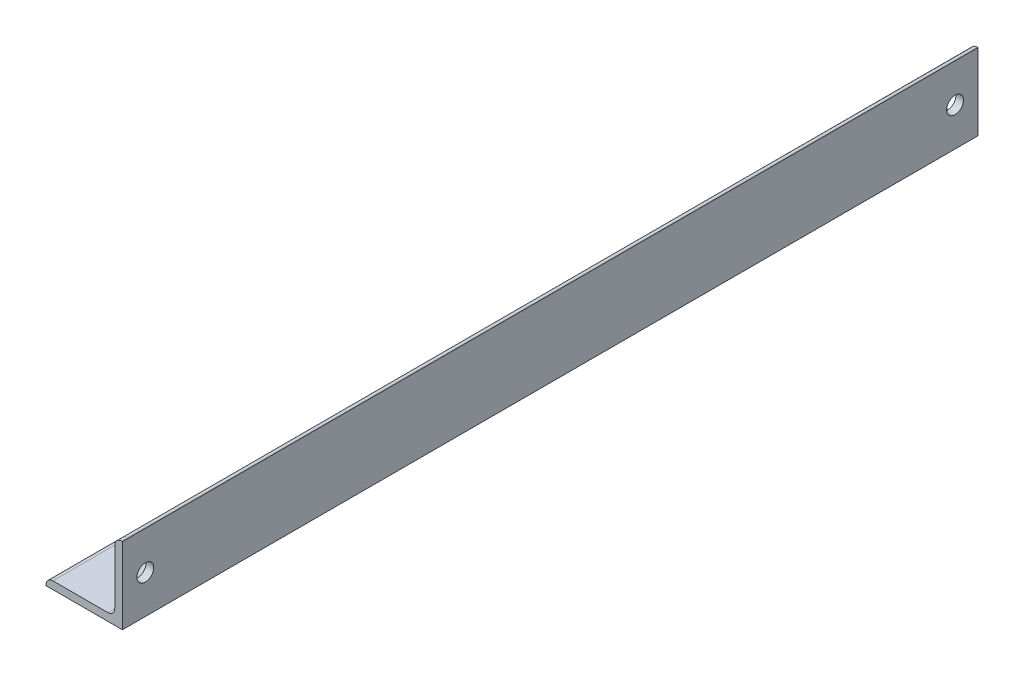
ISO-10303-21;
HEADER;
FILE_DESCRIPTION(('STEP AP214'),'2;1');
FILE_NAME('part.step','',(''),(''),'','','');
FILE_SCHEMA(('AUTOMOTIVE_DESIGN { 1 0 10303 214 1 1 1 1 }'));
ENDSEC;
DATA;
#1=APPLICATION_CONTEXT('core data for automotive mechanical design processes');
#2=APPLICATION_PROTOCOL_DEFINITION('international standard','automotive_design',2000,#1);
#3=PRODUCT_CONTEXT('',#1,'mechanical');
#4=PRODUCT('Part','Part','',(#3));
#5=PRODUCT_RELATED_PRODUCT_CATEGORY('part','',(#4));
#6=PRODUCT_DEFINITION_FORMATION('','',#4);
#7=PRODUCT_DEFINITION_CONTEXT('part definition',#1,'design');
#8=PRODUCT_DEFINITION('design','',#6,#7);
#9=PRODUCT_DEFINITION_SHAPE('','',#8);
#10=(LENGTH_UNIT() NAMED_UNIT(*) SI_UNIT(.MILLI.,.METRE.));
#11=(NAMED_UNIT(*) PLANE_ANGLE_UNIT() SI_UNIT($,.RADIAN.));
#12=(NAMED_UNIT(*) SI_UNIT($,.STERADIAN.) SOLID_ANGLE_UNIT());
#13=UNCERTAINTY_MEASURE_WITH_UNIT(LENGTH_MEASURE(1.E-05),#10,'distance_accuracy_value','');
#14=(GEOMETRIC_REPRESENTATION_CONTEXT(3) GLOBAL_UNCERTAINTY_ASSIGNED_CONTEXT((#13)) GLOBAL_UNIT_ASSIGNED_CONTEXT((#10,
#11,#12)) REPRESENTATION_CONTEXT('',''));
#15=CARTESIAN_POINT('',(0.,0.,0.));
#16=DIRECTION('',(0.,0.,1.));
#17=DIRECTION('',(1.,0.,0.));
#18=AXIS2_PLACEMENT_3D('',#15,#16,#17);
#19=CARTESIAN_POINT('',(0.,0.,560.));
#20=DIRECTION('',(0.,1.,0.));
#21=DIRECTION('',(-1.,0.,0.));
#22=AXIS2_PLACEMENT_3D('',#19,#20,#21);
#23=PLANE('',#22);
#24=DIRECTION('',(1.,0.,0.));
#25=VECTOR('',#24,1.);
#26=CARTESIAN_POINT('',(0.,0.,0.));
#27=LINE('',#26,#25);
#28=CARTESIAN_POINT('',(-50.,0.,0.));
#29=VERTEX_POINT('',#28);
#30=CARTESIAN_POINT('',(0.,0.,0.));
#31=VERTEX_POINT('',#30);
#32=EDGE_CURVE('E105',#29,#31,#27,.T.);
#33=ORIENTED_EDGE('',*,*,#32,.T.);
#34=DIRECTION('',(0.,0.,-1.));
#35=VECTOR('',#34,1.);
#36=CARTESIAN_POINT('',(0.,0.,560.));
#37=LINE('',#36,#35);
#38=CARTESIAN_POINT('',(0.,0.,560.));
#39=VERTEX_POINT('',#38);
#40=EDGE_CURVE('E11',#39,#31,#37,.T.);
#41=ORIENTED_EDGE('',*,*,#40,.F.);
#42=DIRECTION('',(1.,0.,0.));
#43=VECTOR('',#42,1.);
#44=CARTESIAN_POINT('',(0.,0.,560.));
#45=LINE('',#44,#43);
#46=CARTESIAN_POINT('',(-50.,0.,560.));
#47=VERTEX_POINT('',#46);
#48=EDGE_CURVE('E139',#47,#39,#45,.T.);
#49=ORIENTED_EDGE('',*,*,#48,.F.);
#50=DIRECTION('',(0.,0.,-1.));
#51=VECTOR('',#50,1.);
#52=CARTESIAN_POINT('',(-50.,0.,560.));
#53=LINE('',#52,#51);
#54=EDGE_CURVE('E118',#47,#29,#53,.T.);
#55=ORIENTED_EDGE('',*,*,#54,.T.);
#56=EDGE_LOOP('',(#33,#41,#49,#55));
#57=FACE_BOUND('',#56,.T.);
#58=ADVANCED_FACE('F29',(#57),#23,.F.);
#59=CARTESIAN_POINT('',(0.,0.,560.));
#60=DIRECTION('',(-1.,0.,0.));
#61=DIRECTION('',(0.,0.,1.));
#62=AXIS2_PLACEMENT_3D('',#59,#60,#61);
#63=PLANE('',#62);
#64=CARTESIAN_POINT('',(0.,25.,15.));
#65=DIRECTION('',(1.,0.,0.));
#66=DIRECTION('',(0.,0.,-1.));
#67=AXIS2_PLACEMENT_3D('',#64,#65,#66);
#68=CIRCLE('',#67,5.5);
#69=CARTESIAN_POINT('',(0.,25.,9.50000000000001));
#70=VERTEX_POINT('',#69);
#71=EDGE_CURVE('E283',#70,#70,#68,.T.);
#72=ORIENTED_EDGE('',*,*,#71,.F.);
#73=EDGE_LOOP('',(#72));
#74=FACE_BOUND('',#73,.T.);
#75=CARTESIAN_POINT('',(0.,25.,545.));
#76=DIRECTION('',(1.,0.,0.));
#77=DIRECTION('',(0.,0.,-1.));
#78=AXIS2_PLACEMENT_3D('',#75,#76,#77);
#79=CIRCLE('',#78,5.49999999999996);
#80=CARTESIAN_POINT('',(0.,25.,539.5));
#81=VERTEX_POINT('',#80);
#82=EDGE_CURVE('E122',#81,#81,#79,.T.);
#83=ORIENTED_EDGE('',*,*,#82,.F.);
#84=EDGE_LOOP('',(#83));
#85=FACE_BOUND('',#84,.T.);
#86=DIRECTION('',(0.,1.,0.));
#87=VECTOR('',#86,1.);
#88=CARTESIAN_POINT('',(0.,0.,0.));
#89=LINE('',#88,#87);
#90=CARTESIAN_POINT('',(0.,50.,0.));
#91=VERTEX_POINT('',#90);
#92=EDGE_CURVE('E101',#31,#91,#89,.T.);
#93=ORIENTED_EDGE('',*,*,#92,.T.);
#94=DIRECTION('',(0.,0.,-1.));
#95=VECTOR('',#94,1.);
#96=CARTESIAN_POINT('',(0.,50.,560.));
#97=LINE('',#96,#95);
#98=CARTESIAN_POINT('',(0.,50.,560.));
#99=VERTEX_POINT('',#98);
#100=EDGE_CURVE('E37',#99,#91,#97,.T.);
#101=ORIENTED_EDGE('',*,*,#100,.F.);
#102=DIRECTION('',(0.,1.,0.));
#103=VECTOR('',#102,1.);
#104=CARTESIAN_POINT('',(0.,0.,560.));
#105=LINE('',#104,#103);
#106=EDGE_CURVE('E114',#39,#99,#105,.T.);
#107=ORIENTED_EDGE('',*,*,#106,.F.);
#108=ORIENTED_EDGE('',*,*,#40,.T.);
#109=EDGE_LOOP('',(#93,#101,#107,#108));
#110=FACE_BOUND('',#109,.T.);
#111=ADVANCED_FACE('F113',(#74,#85,#110),#63,.F.);
#112=CARTESIAN_POINT('',(0.,50.,560.));
#113=DIRECTION('',(0.,-1.,0.));
#114=DIRECTION('',(0.,0.,-1.));
#115=AXIS2_PLACEMENT_3D('',#112,#113,#114);
#116=PLANE('',#115);
#117=DIRECTION('',(-1.,0.,0.));
#118=VECTOR('',#117,1.);
#119=CARTESIAN_POINT('',(0.,50.,0.));
#120=LINE('',#119,#118);
#121=CARTESIAN_POINT('',(-0.499999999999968,50.,0.));
#122=VERTEX_POINT('',#121);
#123=EDGE_CURVE('E107',#91,#122,#120,.T.);
#124=ORIENTED_EDGE('',*,*,#123,.T.);
#125=DIRECTION('',(0.,0.,-1.));
#126=VECTOR('',#125,1.);
#127=CARTESIAN_POINT('',(-0.499999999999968,50.,560.));
#128=LINE('',#127,#126);
#129=CARTESIAN_POINT('',(-0.499999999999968,50.,560.));
#130=VERTEX_POINT('',#129);
#131=EDGE_CURVE('E170',#130,#122,#128,.T.);
#132=ORIENTED_EDGE('',*,*,#131,.F.);
#133=DIRECTION('',(-1.,0.,0.));
#134=VECTOR('',#133,1.);
#135=CARTESIAN_POINT('',(0.,50.,560.));
#136=LINE('',#135,#134);
#137=EDGE_CURVE('E142',#99,#130,#136,.T.);
#138=ORIENTED_EDGE('',*,*,#137,.F.);
#139=ORIENTED_EDGE('',*,*,#100,.T.);
#140=EDGE_LOOP('',(#124,#132,#138,#139));
#141=FACE_BOUND('',#140,.T.);
#142=ADVANCED_FACE('F175',(#141),#116,.F.);
#143=CARTESIAN_POINT('',(-0.5,45.5,560.));
#144=DIRECTION('',(0.,0.,-1.));
#145=DIRECTION('',(-1.,0.,0.));
#146=AXIS2_PLACEMENT_3D('',#143,#144,#145);
#147=CYLINDRICAL_SURFACE('',#146,4.5);
#148=CARTESIAN_POINT('',(-0.5,45.5,0.));
#149=DIRECTION('',(0.,0.,1.));
#150=DIRECTION('',(1.,0.,0.));
#151=AXIS2_PLACEMENT_3D('',#148,#149,#150);
#152=CIRCLE('',#151,4.5);
#153=CARTESIAN_POINT('',(-5.,45.5,0.));
#154=VERTEX_POINT('',#153);
#155=EDGE_CURVE('E127',#122,#154,#152,.T.);
#156=ORIENTED_EDGE('',*,*,#155,.T.);
#157=DIRECTION('',(0.,0.,-1.));
#158=VECTOR('',#157,1.);
#159=CARTESIAN_POINT('',(-5.,45.5,560.));
#160=LINE('',#159,#158);
#161=CARTESIAN_POINT('',(-5.,45.5,560.));
#162=VERTEX_POINT('',#161);
#163=EDGE_CURVE('E167',#162,#154,#160,.T.);
#164=ORIENTED_EDGE('',*,*,#163,.F.);
#165=CARTESIAN_POINT('',(-0.5,45.5,560.));
#166=DIRECTION('',(0.,0.,1.));
#167=DIRECTION('',(1.,0.,0.));
#168=AXIS2_PLACEMENT_3D('',#165,#166,#167);
#169=CIRCLE('',#168,4.5);
#170=EDGE_CURVE('E144',#130,#162,#169,.T.);
#171=ORIENTED_EDGE('',*,*,#170,.F.);
#172=ORIENTED_EDGE('',*,*,#131,.T.);
#173=EDGE_LOOP('',(#156,#164,#171,#172));
#174=FACE_BOUND('',#173,.T.);
#175=ADVANCED_FACE('F183',(#174),#147,.T.);
#176=CARTESIAN_POINT('',(-5.,9.50000000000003,560.));
#177=DIRECTION('',(1.,0.,0.));
#178=DIRECTION('',(0.,0.,-1.));
#179=AXIS2_PLACEMENT_3D('',#176,#177,#178);
#180=PLANE('',#179);
#181=CARTESIAN_POINT('',(-5.,25.,15.));
#182=DIRECTION('',(1.,0.,0.));
#183=DIRECTION('',(0.,0.,-1.));
#184=AXIS2_PLACEMENT_3D('',#181,#182,#183);
#185=CIRCLE('',#184,5.5);
#186=CARTESIAN_POINT('',(-5.,25.,9.50000000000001));
#187=VERTEX_POINT('',#186);
#188=EDGE_CURVE('E32',#187,#187,#185,.T.);
#189=ORIENTED_EDGE('',*,*,#188,.T.);
#190=EDGE_LOOP('',(#189));
#191=FACE_BOUND('',#190,.T.);
#192=CARTESIAN_POINT('',(-5.,25.,545.));
#193=DIRECTION('',(1.,0.,0.));
#194=DIRECTION('',(0.,0.,-1.));
#195=AXIS2_PLACEMENT_3D('',#192,#193,#194);
#196=CIRCLE('',#195,5.49999999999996);
#197=CARTESIAN_POINT('',(-5.,25.,539.5));
#198=VERTEX_POINT('',#197);
#199=EDGE_CURVE('E119',#198,#198,#196,.T.);
#200=ORIENTED_EDGE('',*,*,#199,.T.);
#201=EDGE_LOOP('',(#200));
#202=FACE_BOUND('',#201,.T.);
#203=DIRECTION('',(0.,-1.,0.));
#204=VECTOR('',#203,1.);
#205=CARTESIAN_POINT('',(-5.,9.50000000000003,0.));
#206=LINE('',#205,#204);
#207=CARTESIAN_POINT('',(-5.,9.50000000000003,0.));
#208=VERTEX_POINT('',#207);
#209=EDGE_CURVE('E129',#154,#208,#206,.T.);
#210=ORIENTED_EDGE('',*,*,#209,.T.);
#211=DIRECTION('',(0.,0.,-1.));
#212=VECTOR('',#211,1.);
#213=CARTESIAN_POINT('',(-5.,9.50000000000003,560.));
#214=LINE('',#213,#212);
#215=CARTESIAN_POINT('',(-5.,9.50000000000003,560.));
#216=VERTEX_POINT('',#215);
#217=EDGE_CURVE('E164',#216,#208,#214,.T.);
#218=ORIENTED_EDGE('',*,*,#217,.F.);
#219=DIRECTION('',(0.,-1.,0.));
#220=VECTOR('',#219,1.);
#221=CARTESIAN_POINT('',(-5.,9.50000000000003,560.));
#222=LINE('',#221,#220);
#223=EDGE_CURVE('E146',#162,#216,#222,.T.);
#224=ORIENTED_EDGE('',*,*,#223,.F.);
#225=ORIENTED_EDGE('',*,*,#163,.T.);
#226=EDGE_LOOP('',(#210,#218,#224,#225));
#227=FACE_BOUND('',#226,.T.);
#228=ADVANCED_FACE('F186',(#191,#202,#227),#180,.F.);
#229=CARTESIAN_POINT('',(-9.5,9.5,560.));
#230=DIRECTION('',(0.,0.,-1.));
#231=DIRECTION('',(-1.,0.,0.));
#232=AXIS2_PLACEMENT_3D('',#229,#230,#231);
#233=CYLINDRICAL_SURFACE('',#232,4.5);
#234=CARTESIAN_POINT('',(-9.5,9.5,0.));
#235=DIRECTION('',(0.,0.,-1.));
#236=DIRECTION('',(1.,0.,0.));
#237=AXIS2_PLACEMENT_3D('',#234,#235,#236);
#238=CIRCLE('',#237,4.5);
#239=CARTESIAN_POINT('',(-9.50000000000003,5.,0.));
#240=VERTEX_POINT('',#239);
#241=EDGE_CURVE('E131',#208,#240,#238,.T.);
#242=ORIENTED_EDGE('',*,*,#241,.T.);
#243=DIRECTION('',(0.,0.,-1.));
#244=VECTOR('',#243,1.);
#245=CARTESIAN_POINT('',(-9.50000000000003,5.,560.));
#246=LINE('',#245,#244);
#247=CARTESIAN_POINT('',(-9.50000000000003,5.,560.));
#248=VERTEX_POINT('',#247);
#249=EDGE_CURVE('E161',#248,#240,#246,.T.);
#250=ORIENTED_EDGE('',*,*,#249,.F.);
#251=CARTESIAN_POINT('',(-9.5,9.5,560.));
#252=DIRECTION('',(0.,0.,-1.));
#253=DIRECTION('',(1.,0.,0.));
#254=AXIS2_PLACEMENT_3D('',#251,#252,#253);
#255=CIRCLE('',#254,4.5);
#256=EDGE_CURVE('E148',#216,#248,#255,.T.);
#257=ORIENTED_EDGE('',*,*,#256,.F.);
#258=ORIENTED_EDGE('',*,*,#217,.T.);
#259=EDGE_LOOP('',(#242,#250,#257,#258));
#260=FACE_BOUND('',#259,.T.);
#261=ADVANCED_FACE('F191',(#260),#233,.F.);
#262=CARTESIAN_POINT('',(-9.50000000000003,5.,560.));
#263=DIRECTION('',(0.,-1.,0.));
#264=DIRECTION('',(1.,0.,0.));
#265=AXIS2_PLACEMENT_3D('',#262,#263,#264);
#266=PLANE('',#265);
#267=DIRECTION('',(-1.,0.,0.));
#268=VECTOR('',#267,1.);
#269=CARTESIAN_POINT('',(-9.50000000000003,5.,0.));
#270=LINE('',#269,#268);
#271=CARTESIAN_POINT('',(-45.5,4.99999999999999,0.));
#272=VERTEX_POINT('',#271);
#273=EDGE_CURVE('E133',#240,#272,#270,.T.);
#274=ORIENTED_EDGE('',*,*,#273,.T.);
#275=DIRECTION('',(0.,0.,-1.));
#276=VECTOR('',#275,1.);
#277=CARTESIAN_POINT('',(-45.5,4.99999999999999,560.));
#278=LINE('',#277,#276);
#279=CARTESIAN_POINT('',(-45.5,4.99999999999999,560.));
#280=VERTEX_POINT('',#279);
#281=EDGE_CURVE('E158',#280,#272,#278,.T.);
#282=ORIENTED_EDGE('',*,*,#281,.F.);
#283=DIRECTION('',(-1.,0.,0.));
#284=VECTOR('',#283,1.);
#285=CARTESIAN_POINT('',(-9.50000000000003,5.,560.));
#286=LINE('',#285,#284);
#287=EDGE_CURVE('E150',#248,#280,#286,.T.);
#288=ORIENTED_EDGE('',*,*,#287,.F.);
#289=ORIENTED_EDGE('',*,*,#249,.T.);
#290=EDGE_LOOP('',(#274,#282,#288,#289));
#291=FACE_BOUND('',#290,.T.);
#292=ADVANCED_FACE('F195',(#291),#266,.F.);
#293=CARTESIAN_POINT('',(-45.5,0.499999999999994,560.));
#294=DIRECTION('',(0.,0.,-1.));
#295=DIRECTION('',(-1.,0.,0.));
#296=AXIS2_PLACEMENT_3D('',#293,#294,#295);
#297=CYLINDRICAL_SURFACE('',#296,4.5);
#298=CARTESIAN_POINT('',(-45.5,0.499999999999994,0.));
#299=DIRECTION('',(0.,0.,1.));
#300=DIRECTION('',(1.,0.,0.));
#301=AXIS2_PLACEMENT_3D('',#298,#299,#300);
#302=CIRCLE('',#301,4.5);
#303=CARTESIAN_POINT('',(-50.,0.499999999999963,0.));
#304=VERTEX_POINT('',#303);
#305=EDGE_CURVE('E135',#272,#304,#302,.T.);
#306=ORIENTED_EDGE('',*,*,#305,.T.);
#307=DIRECTION('',(0.,0.,-1.));
#308=VECTOR('',#307,1.);
#309=CARTESIAN_POINT('',(-50.,0.499999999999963,560.));
#310=LINE('',#309,#308);
#311=CARTESIAN_POINT('',(-50.,0.499999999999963,560.));
#312=VERTEX_POINT('',#311);
#313=EDGE_CURVE('E155',#312,#304,#310,.T.);
#314=ORIENTED_EDGE('',*,*,#313,.F.);
#315=CARTESIAN_POINT('',(-45.5,0.499999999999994,560.));
#316=DIRECTION('',(0.,0.,1.));
#317=DIRECTION('',(1.,0.,0.));
#318=AXIS2_PLACEMENT_3D('',#315,#316,#317);
#319=CIRCLE('',#318,4.5);
#320=EDGE_CURVE('E50',#280,#312,#319,.T.);
#321=ORIENTED_EDGE('',*,*,#320,.F.);
#322=ORIENTED_EDGE('',*,*,#281,.T.);
#323=EDGE_LOOP('',(#306,#314,#321,#322));
#324=FACE_BOUND('',#323,.T.);
#325=ADVANCED_FACE('F199',(#324),#297,.T.);
#326=CARTESIAN_POINT('',(-50.,0.,560.));
#327=DIRECTION('',(1.,0.,0.));
#328=DIRECTION('',(0.,0.,-1.));
#329=AXIS2_PLACEMENT_3D('',#326,#327,#328);
#330=PLANE('',#329);
#331=DIRECTION('',(0.,-1.,0.));
#332=VECTOR('',#331,1.);
#333=CARTESIAN_POINT('',(-50.,0.,0.));
#334=LINE('',#333,#332);
#335=EDGE_CURVE('E137',#304,#29,#334,.T.);
#336=ORIENTED_EDGE('',*,*,#335,.T.);
#337=ORIENTED_EDGE('',*,*,#54,.F.);
#338=DIRECTION('',(0.,-1.,0.));
#339=VECTOR('',#338,1.);
#340=CARTESIAN_POINT('',(-50.,0.,560.));
#341=LINE('',#340,#339);
#342=EDGE_CURVE('E45',#312,#47,#341,.T.);
#343=ORIENTED_EDGE('',*,*,#342,.F.);
#344=ORIENTED_EDGE('',*,*,#313,.T.);
#345=EDGE_LOOP('',(#336,#337,#343,#344));
#346=FACE_BOUND('',#345,.T.);
#347=ADVANCED_FACE('F201',(#346),#330,.F.);
#348=CARTESIAN_POINT('',(-45.5,0.499999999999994,560.));
#349=DIRECTION('',(0.,0.,1.));
#350=DIRECTION('',(1.,0.,0.));
#351=AXIS2_PLACEMENT_3D('',#348,#349,#350);
#352=PLANE('',#351);
#353=ORIENTED_EDGE('',*,*,#48,.T.);
#354=ORIENTED_EDGE('',*,*,#106,.T.);
#355=ORIENTED_EDGE('',*,*,#137,.T.);
#356=ORIENTED_EDGE('',*,*,#170,.T.);
#357=ORIENTED_EDGE('',*,*,#223,.T.);
#358=ORIENTED_EDGE('',*,*,#256,.T.);
#359=ORIENTED_EDGE('',*,*,#287,.T.);
#360=ORIENTED_EDGE('',*,*,#320,.T.);
#361=ORIENTED_EDGE('',*,*,#342,.T.);
#362=EDGE_LOOP('',(#353,#354,#355,#356,#357,#358,#359,#360,#361));
#363=FACE_BOUND('',#362,.T.);
#364=ADVANCED_FACE('F178',(#363),#352,.T.);
#365=CARTESIAN_POINT('',(-45.5,0.499999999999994,0.));
#366=DIRECTION('',(0.,0.,1.));
#367=DIRECTION('',(1.,0.,0.));
#368=AXIS2_PLACEMENT_3D('',#365,#366,#367);
#369=PLANE('',#368);
#370=ORIENTED_EDGE('',*,*,#32,.F.);
#371=ORIENTED_EDGE('',*,*,#335,.F.);
#372=ORIENTED_EDGE('',*,*,#305,.F.);
#373=ORIENTED_EDGE('',*,*,#273,.F.);
#374=ORIENTED_EDGE('',*,*,#241,.F.);
#375=ORIENTED_EDGE('',*,*,#209,.F.);
#376=ORIENTED_EDGE('',*,*,#155,.F.);
#377=ORIENTED_EDGE('',*,*,#123,.F.);
#378=ORIENTED_EDGE('',*,*,#92,.F.);
#379=EDGE_LOOP('',(#370,#371,#372,#373,#374,#375,#376,#377,#378));
#380=FACE_BOUND('',#379,.T.);
#381=ADVANCED_FACE('F102',(#380),#369,.F.);
#382=CARTESIAN_POINT('',(-50.,25.,545.));
#383=DIRECTION('',(1.,0.,0.));
#384=DIRECTION('',(0.,0.,-1.));
#385=AXIS2_PLACEMENT_3D('',#382,#383,#384);
#386=CYLINDRICAL_SURFACE('',#385,5.49999999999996);
#387=ORIENTED_EDGE('',*,*,#82,.T.);
#388=EDGE_LOOP('',(#387));
#389=FACE_BOUND('',#388,.T.);
#390=ORIENTED_EDGE('',*,*,#199,.F.);
#391=EDGE_LOOP('',(#390));
#392=FACE_BOUND('',#391,.T.);
#393=ADVANCED_FACE('F258',(#389,#392),#386,.F.);
#394=CARTESIAN_POINT('',(-50.,25.,15.));
#395=DIRECTION('',(1.,0.,0.));
#396=DIRECTION('',(0.,0.,-1.));
#397=AXIS2_PLACEMENT_3D('',#394,#395,#396);
#398=CYLINDRICAL_SURFACE('',#397,5.5);
#399=ORIENTED_EDGE('',*,*,#71,.T.);
#400=EDGE_LOOP('',(#399));
#401=FACE_BOUND('',#400,.T.);
#402=ORIENTED_EDGE('',*,*,#188,.F.);
#403=EDGE_LOOP('',(#402));
#404=FACE_BOUND('',#403,.T.);
#405=ADVANCED_FACE('F267',(#401,#404),#398,.F.);
#406=CLOSED_SHELL('',(#58,#111,#142,#175,#228,#261,#292,#325,#347,#364,#381,#393,#405));
#407=MANIFOLD_SOLID_BREP('B2',#406);
#408=ADVANCED_BREP_SHAPE_REPRESENTATION('',(#18,#407),#14);
#409=SHAPE_DEFINITION_REPRESENTATION(#9,#408);
ENDSEC;
END-ISO-10303-21;
